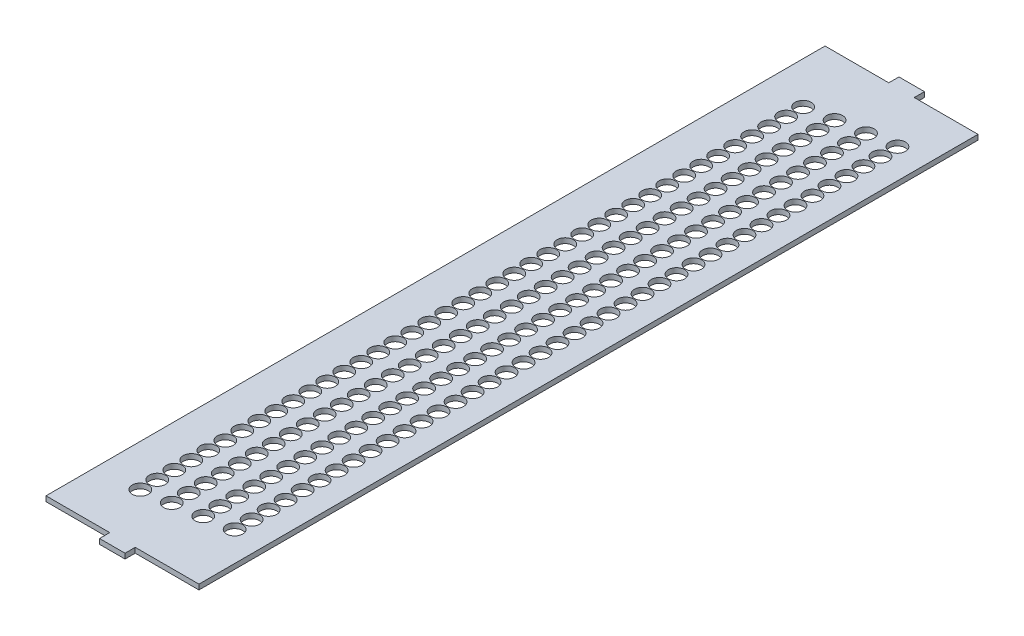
from build123d import *

# Parameters (mm, degrees)
CROQUIS1_R              = 4.75
SALIENTE_EXTRUIR1_DEPTH = 3


with BuildPart() as part:
    # Croquis1 → Saliente-Extruir1 (new body)
    with BuildSketch(Plane(origin=(0, 0, 0), x_dir=(1, 0, 0), z_dir=(0, 1, 0))):
        Polygon((0, 0), (37.5, 0), (37.5, -6), (52.5, -6), (52.5, 0), (90, 0), (90, 458.4), (52.5, 458.4), (52.5, 464.4), (37.5, 464.4), (37.5, 458.4), (0, 458.4), align=None)
        with Locations(Location((24.6, 420.9, 0), (0, 0, 270))):
            Circle(CROQUIS1_R, mode=Mode.SUBTRACT)
        with Locations(Location((40.6, 423.4, 0), (0, 0, 270))):
            Circle(CROQUIS1_R, mode=Mode.SUBTRACT)
        with Locations(Location((56.6, 425.9, 0), (0, 0, 270))):
            Circle(CROQUIS1_R, mode=Mode.SUBTRACT)
        with Locations(Location((72.6, 428.4, 0), (0, 0, 270))):
            Circle(CROQUIS1_R, mode=Mode.SUBTRACT)
        with Locations(Location((24.6, 410.9, 0), (0, 0, 270))):
            Circle(CROQUIS1_R, mode=Mode.SUBTRACT)
        with Locations(Location((40.6, 413.4, 0), (0, 0, 270))):
            Circle(CROQUIS1_R, mode=Mode.SUBTRACT)
        with Locations(Location((56.6, 415.9, 0), (0, 0, 270))):
            Circle(CROQUIS1_R, mode=Mode.SUBTRACT)
        with Locations(Location((72.6, 418.4, 0), (0, 0, 270))):
            Circle(CROQUIS1_R, mode=Mode.SUBTRACT)
        with Locations(Location((24.6, 400.9, 0), (0, 0, 270))):
            Circle(CROQUIS1_R, mode=Mode.SUBTRACT)
        with Locations(Location((40.6, 403.4, 0), (0, 0, 270))):
            Circle(CROQUIS1_R, mode=Mode.SUBTRACT)
        with Locations(Location((56.6, 405.9, 0), (0, 0, 270))):
            Circle(CROQUIS1_R, mode=Mode.SUBTRACT)
        with Locations(Location((72.6, 408.4, 0), (0, 0, 270))):
            Circle(CROQUIS1_R, mode=Mode.SUBTRACT)
        with Locations(Location((24.6, 390.9, 0), (0, 0, 270))):
            Circle(CROQUIS1_R, mode=Mode.SUBTRACT)
        with Locations(Location((40.6, 393.4, 0), (0, 0, 270))):
            Circle(CROQUIS1_R, mode=Mode.SUBTRACT)
        with Locations(Location((56.6, 395.9, 0), (0, 0, 270))):
            Circle(CROQUIS1_R, mode=Mode.SUBTRACT)
        with Locations(Location((72.6, 398.4, 0), (0, 0, 270))):
            Circle(CROQUIS1_R, mode=Mode.SUBTRACT)
        with Locations(Location((24.6, 380.9, 0), (0, 0, 270))):
            Circle(CROQUIS1_R, mode=Mode.SUBTRACT)
        with Locations(Location((40.6, 383.4, 0), (0, 0, 270))):
            Circle(CROQUIS1_R, mode=Mode.SUBTRACT)
        with Locations(Location((56.6, 385.9, 0), (0, 0, 270))):
            Circle(CROQUIS1_R, mode=Mode.SUBTRACT)
        with Locations(Location((72.6, 388.4, 0), (0, 0, 270))):
            Circle(CROQUIS1_R, mode=Mode.SUBTRACT)
        with Locations(Location((24.6, 370.9, 0), (0, 0, 270))):
            Circle(CROQUIS1_R, mode=Mode.SUBTRACT)
        with Locations(Location((40.6, 373.4, 0), (0, 0, 270))):
            Circle(CROQUIS1_R, mode=Mode.SUBTRACT)
        with Locations(Location((56.6, 375.9, 0), (0, 0, 270))):
            Circle(CROQUIS1_R, mode=Mode.SUBTRACT)
        with Locations(Location((72.6, 378.4, 0), (0, 0, 270))):
            Circle(CROQUIS1_R, mode=Mode.SUBTRACT)
        with Locations(Location((24.6, 360.9, 0), (0, 0, 270))):
            Circle(CROQUIS1_R, mode=Mode.SUBTRACT)
        with Locations(Location((40.6, 363.4, 0), (0, 0, 270))):
            Circle(CROQUIS1_R, mode=Mode.SUBTRACT)
        with Locations(Location((56.6, 365.9, 0), (0, 0, 270))):
            Circle(CROQUIS1_R, mode=Mode.SUBTRACT)
        with Locations(Location((72.6, 368.4, 0), (0, 0, 270))):
            Circle(CROQUIS1_R, mode=Mode.SUBTRACT)
        with Locations(Location((24.6, 350.9, 0), (0, 0, 270))):
            Circle(CROQUIS1_R, mode=Mode.SUBTRACT)
        with Locations(Location((40.6, 353.4, 0), (0, 0, 270))):
            Circle(CROQUIS1_R, mode=Mode.SUBTRACT)
        with Locations(Location((56.6, 355.9, 0), (0, 0, 270))):
            Circle(CROQUIS1_R, mode=Mode.SUBTRACT)
        with Locations(Location((72.6, 358.4, 0), (0, 0, 270))):
            Circle(CROQUIS1_R, mode=Mode.SUBTRACT)
        with Locations(Location((24.6, 340.9, 0), (0, 0, 270))):
            Circle(CROQUIS1_R, mode=Mode.SUBTRACT)
        with Locations(Location((40.6, 343.4, 0), (0, 0, 270))):
            Circle(CROQUIS1_R, mode=Mode.SUBTRACT)
        with Locations(Location((56.6, 345.9, 0), (0, 0, 270))):
            Circle(CROQUIS1_R, mode=Mode.SUBTRACT)
        with Locations(Location((72.6, 348.4, 0), (0, 0, 270))):
            Circle(CROQUIS1_R, mode=Mode.SUBTRACT)
        with Locations(Location((24.6, 330.9, 0), (0, 0, 270))):
            Circle(CROQUIS1_R, mode=Mode.SUBTRACT)
        with Locations(Location((40.6, 333.4, 0), (0, 0, 270))):
            Circle(CROQUIS1_R, mode=Mode.SUBTRACT)
        with Locations(Location((56.6, 335.9, 0), (0, 0, 270))):
            Circle(CROQUIS1_R, mode=Mode.SUBTRACT)
        with Locations(Location((72.6, 338.4, 0), (0, 0, 270))):
            Circle(CROQUIS1_R, mode=Mode.SUBTRACT)
        with Locations(Location((24.6, 320.9, 0), (0, 0, 270))):
            Circle(CROQUIS1_R, mode=Mode.SUBTRACT)
        with Locations(Location((40.6, 323.4, 0), (0, 0, 270))):
            Circle(CROQUIS1_R, mode=Mode.SUBTRACT)
        with Locations(Location((56.6, 325.9, 0), (0, 0, 270))):
            Circle(CROQUIS1_R, mode=Mode.SUBTRACT)
        with Locations(Location((72.6, 328.4, 0), (0, 0, 270))):
            Circle(CROQUIS1_R, mode=Mode.SUBTRACT)
        with Locations(Location((24.6, 310.9, 0), (0, 0, 270))):
            Circle(CROQUIS1_R, mode=Mode.SUBTRACT)
        with Locations(Location((40.6, 313.4, 0), (0, 0, 270))):
            Circle(CROQUIS1_R, mode=Mode.SUBTRACT)
        with Locations(Location((56.6, 315.9, 0), (0, 0, 270))):
            Circle(CROQUIS1_R, mode=Mode.SUBTRACT)
        with Locations(Location((72.6, 318.4, 0), (0, 0, 270))):
            Circle(CROQUIS1_R, mode=Mode.SUBTRACT)
        with Locations(Location((24.6, 300.9, 0), (0, 0, 270))):
            Circle(CROQUIS1_R, mode=Mode.SUBTRACT)
        with Locations(Location((40.6, 303.4, 0), (0, 0, 270))):
            Circle(CROQUIS1_R, mode=Mode.SUBTRACT)
        with Locations(Location((56.6, 305.9, 0), (0, 0, 270))):
            Circle(CROQUIS1_R, mode=Mode.SUBTRACT)
        with Locations(Location((72.6, 308.4, 0), (0, 0, 270))):
            Circle(CROQUIS1_R, mode=Mode.SUBTRACT)
        with Locations(Location((24.6, 290.9, 0), (0, 0, 270))):
            Circle(CROQUIS1_R, mode=Mode.SUBTRACT)
        with Locations(Location((40.6, 293.4, 0), (0, 0, 270))):
            Circle(CROQUIS1_R, mode=Mode.SUBTRACT)
        with Locations(Location((56.6, 295.9, 0), (0, 0, 270))):
            Circle(CROQUIS1_R, mode=Mode.SUBTRACT)
        with Locations(Location((72.6, 298.4, 0), (0, 0, 270))):
            Circle(CROQUIS1_R, mode=Mode.SUBTRACT)
        with Locations(Location((24.6, 280.9, 0), (0, 0, 270))):
            Circle(CROQUIS1_R, mode=Mode.SUBTRACT)
        with Locations(Location((40.6, 283.4, 0), (0, 0, 270))):
            Circle(CROQUIS1_R, mode=Mode.SUBTRACT)
        with Locations(Location((56.6, 285.9, 0), (0, 0, 270))):
            Circle(CROQUIS1_R, mode=Mode.SUBTRACT)
        with Locations(Location((72.6, 288.4, 0), (0, 0, 270))):
            Circle(CROQUIS1_R, mode=Mode.SUBTRACT)
        with Locations(Location((24.6, 270.9, 0), (0, 0, 270))):
            Circle(CROQUIS1_R, mode=Mode.SUBTRACT)
        with Locations(Location((40.6, 273.4, 0), (0, 0, 270))):
            Circle(CROQUIS1_R, mode=Mode.SUBTRACT)
        with Locations(Location((56.6, 275.9, 0), (0, 0, 270))):
            Circle(CROQUIS1_R, mode=Mode.SUBTRACT)
        with Locations(Location((72.6, 278.4, 0), (0, 0, 270))):
            Circle(CROQUIS1_R, mode=Mode.SUBTRACT)
        with Locations(Location((24.6, 260.9, 0), (0, 0, 270))):
            Circle(CROQUIS1_R, mode=Mode.SUBTRACT)
        with Locations(Location((40.6, 263.4, 0), (0, 0, 270))):
            Circle(CROQUIS1_R, mode=Mode.SUBTRACT)
        with Locations(Location((56.6, 265.9, 0), (0, 0, 270))):
            Circle(CROQUIS1_R, mode=Mode.SUBTRACT)
        with Locations(Location((72.6, 268.4, 0), (0, 0, 270))):
            Circle(CROQUIS1_R, mode=Mode.SUBTRACT)
        with Locations(Location((24.6, 250.9, 0), (0, 0, 270))):
            Circle(CROQUIS1_R, mode=Mode.SUBTRACT)
        with Locations(Location((40.6, 253.4, 0), (0, 0, 270))):
            Circle(CROQUIS1_R, mode=Mode.SUBTRACT)
        with Locations(Location((56.6, 255.9, 0), (0, 0, 270))):
            Circle(CROQUIS1_R, mode=Mode.SUBTRACT)
        with Locations(Location((72.6, 258.4, 0), (0, 0, 270))):
            Circle(CROQUIS1_R, mode=Mode.SUBTRACT)
        with Locations(Location((24.6, 240.9, 0), (0, 0, 270))):
            Circle(CROQUIS1_R, mode=Mode.SUBTRACT)
        with Locations(Location((40.6, 243.4, 0), (0, 0, 270))):
            Circle(CROQUIS1_R, mode=Mode.SUBTRACT)
        with Locations(Location((56.6, 245.9, 0), (0, 0, 270))):
            Circle(CROQUIS1_R, mode=Mode.SUBTRACT)
        with Locations(Location((72.6, 248.4, 0), (0, 0, 270))):
            Circle(CROQUIS1_R, mode=Mode.SUBTRACT)
        with Locations(Location((24.6, 230.9, 0), (0, 0, 270))):
            Circle(CROQUIS1_R, mode=Mode.SUBTRACT)
        with Locations(Location((40.6, 233.4, 0), (0, 0, 270))):
            Circle(CROQUIS1_R, mode=Mode.SUBTRACT)
        with Locations(Location((56.6, 235.9, 0), (0, 0, 270))):
            Circle(CROQUIS1_R, mode=Mode.SUBTRACT)
        with Locations(Location((72.6, 238.4, 0), (0, 0, 270))):
            Circle(CROQUIS1_R, mode=Mode.SUBTRACT)
        with Locations(Location((24.6, 220.9, 0), (0, 0, 270))):
            Circle(CROQUIS1_R, mode=Mode.SUBTRACT)
        with Locations(Location((40.6, 223.4, 0), (0, 0, 270))):
            Circle(CROQUIS1_R, mode=Mode.SUBTRACT)
        with Locations(Location((56.6, 225.9, 0), (0, 0, 270))):
            Circle(CROQUIS1_R, mode=Mode.SUBTRACT)
        with Locations(Location((72.6, 228.4, 0), (0, 0, 270))):
            Circle(CROQUIS1_R, mode=Mode.SUBTRACT)
        with Locations(Location((24.6, 210.9, 0), (0, 0, 270))):
            Circle(CROQUIS1_R, mode=Mode.SUBTRACT)
        with Locations(Location((40.6, 213.4, 0), (0, 0, 270))):
            Circle(CROQUIS1_R, mode=Mode.SUBTRACT)
        with Locations(Location((56.6, 215.9, 0), (0, 0, 270))):
            Circle(CROQUIS1_R, mode=Mode.SUBTRACT)
        with Locations(Location((72.6, 218.4, 0), (0, 0, 270))):
            Circle(CROQUIS1_R, mode=Mode.SUBTRACT)
        with Locations(Location((24.6, 200.9, 0), (0, 0, 270))):
            Circle(CROQUIS1_R, mode=Mode.SUBTRACT)
        with Locations(Location((40.6, 203.4, 0), (0, 0, 270))):
            Circle(CROQUIS1_R, mode=Mode.SUBTRACT)
        with Locations(Location((56.6, 205.9, 0), (0, 0, 270))):
            Circle(CROQUIS1_R, mode=Mode.SUBTRACT)
        with Locations(Location((72.6, 208.4, 0), (0, 0, 270))):
            Circle(CROQUIS1_R, mode=Mode.SUBTRACT)
        with Locations(Location((24.6, 190.9, 0), (0, 0, 270))):
            Circle(CROQUIS1_R, mode=Mode.SUBTRACT)
        with Locations(Location((40.6, 193.4, 0), (0, 0, 270))):
            Circle(CROQUIS1_R, mode=Mode.SUBTRACT)
        with Locations(Location((56.6, 195.9, 0), (0, 0, 270))):
            Circle(CROQUIS1_R, mode=Mode.SUBTRACT)
        with Locations(Location((72.6, 198.4, 0), (0, 0, 270))):
            Circle(CROQUIS1_R, mode=Mode.SUBTRACT)
        with Locations(Location((24.6, 180.9, 0), (0, 0, 270))):
            Circle(CROQUIS1_R, mode=Mode.SUBTRACT)
        with Locations(Location((40.6, 183.4, 0), (0, 0, 270))):
            Circle(CROQUIS1_R, mode=Mode.SUBTRACT)
        with Locations(Location((56.6, 185.9, 0), (0, 0, 270))):
            Circle(CROQUIS1_R, mode=Mode.SUBTRACT)
        with Locations(Location((72.6, 188.4, 0), (0, 0, 270))):
            Circle(CROQUIS1_R, mode=Mode.SUBTRACT)
        with Locations(Location((24.6, 170.9, 0), (0, 0, 270))):
            Circle(CROQUIS1_R, mode=Mode.SUBTRACT)
        with Locations(Location((40.6, 173.4, 0), (0, 0, 270))):
            Circle(CROQUIS1_R, mode=Mode.SUBTRACT)
        with Locations(Location((56.6, 175.9, 0), (0, 0, 270))):
            Circle(CROQUIS1_R, mode=Mode.SUBTRACT)
        with Locations(Location((72.6, 178.4, 0), (0, 0, 270))):
            Circle(CROQUIS1_R, mode=Mode.SUBTRACT)
        with Locations(Location((24.6, 160.9, 0), (0, 0, 270))):
            Circle(CROQUIS1_R, mode=Mode.SUBTRACT)
        with Locations(Location((40.6, 163.4, 0), (0, 0, 270))):
            Circle(CROQUIS1_R, mode=Mode.SUBTRACT)
        with Locations(Location((56.6, 165.9, 0), (0, 0, 270))):
            Circle(CROQUIS1_R, mode=Mode.SUBTRACT)
        with Locations(Location((72.6, 168.4, 0), (0, 0, 270))):
            Circle(CROQUIS1_R, mode=Mode.SUBTRACT)
        with Locations(Location((24.6, 150.9, 0), (0, 0, 270))):
            Circle(CROQUIS1_R, mode=Mode.SUBTRACT)
        with Locations(Location((40.6, 153.4, 0), (0, 0, 270))):
            Circle(CROQUIS1_R, mode=Mode.SUBTRACT)
        with Locations(Location((56.6, 155.9, 0), (0, 0, 270))):
            Circle(CROQUIS1_R, mode=Mode.SUBTRACT)
        with Locations(Location((72.6, 158.4, 0), (0, 0, 270))):
            Circle(CROQUIS1_R, mode=Mode.SUBTRACT)
        with Locations(Location((24.6, 140.9, 0), (0, 0, 270))):
            Circle(CROQUIS1_R, mode=Mode.SUBTRACT)
        with Locations(Location((40.6, 143.4, 0), (0, 0, 270))):
            Circle(CROQUIS1_R, mode=Mode.SUBTRACT)
        with Locations(Location((56.6, 145.9, 0), (0, 0, 270))):
            Circle(CROQUIS1_R, mode=Mode.SUBTRACT)
        with Locations(Location((72.6, 148.4, 0), (0, 0, 270))):
            Circle(CROQUIS1_R, mode=Mode.SUBTRACT)
        with Locations(Location((24.6, 130.9, 0), (0, 0, 270))):
            Circle(CROQUIS1_R, mode=Mode.SUBTRACT)
        with Locations(Location((40.6, 133.4, 0), (0, 0, 270))):
            Circle(CROQUIS1_R, mode=Mode.SUBTRACT)
        with Locations(Location((56.6, 135.9, 0), (0, 0, 270))):
            Circle(CROQUIS1_R, mode=Mode.SUBTRACT)
        with Locations(Location((72.6, 138.4, 0), (0, 0, 270))):
            Circle(CROQUIS1_R, mode=Mode.SUBTRACT)
        with Locations(Location((24.6, 120.9, 0), (0, 0, 270))):
            Circle(CROQUIS1_R, mode=Mode.SUBTRACT)
        with Locations(Location((40.6, 123.4, 0), (0, 0, 270))):
            Circle(CROQUIS1_R, mode=Mode.SUBTRACT)
        with Locations(Location((56.6, 125.9, 0), (0, 0, 270))):
            Circle(CROQUIS1_R, mode=Mode.SUBTRACT)
        with Locations(Location((72.6, 128.4, 0), (0, 0, 270))):
            Circle(CROQUIS1_R, mode=Mode.SUBTRACT)
        with Locations(Location((24.6, 110.9, 0), (0, 0, 270))):
            Circle(CROQUIS1_R, mode=Mode.SUBTRACT)
        with Locations(Location((40.6, 113.4, 0), (0, 0, 270))):
            Circle(CROQUIS1_R, mode=Mode.SUBTRACT)
        with Locations(Location((56.6, 115.9, 0), (0, 0, 270))):
            Circle(CROQUIS1_R, mode=Mode.SUBTRACT)
        with Locations(Location((72.6, 118.4, 0), (0, 0, 270))):
            Circle(CROQUIS1_R, mode=Mode.SUBTRACT)
        with Locations(Location((24.6, 100.9, 0), (0, 0, 270))):
            Circle(CROQUIS1_R, mode=Mode.SUBTRACT)
        with Locations(Location((40.6, 103.4, 0), (0, 0, 270))):
            Circle(CROQUIS1_R, mode=Mode.SUBTRACT)
        with Locations(Location((56.6, 105.9, 0), (0, 0, 270))):
            Circle(CROQUIS1_R, mode=Mode.SUBTRACT)
        with Locations(Location((72.6, 108.4, 0), (0, 0, 270))):
            Circle(CROQUIS1_R, mode=Mode.SUBTRACT)
        with Locations(Location((24.6, 90.9, 0), (0, 0, 270))):
            Circle(CROQUIS1_R, mode=Mode.SUBTRACT)
        with Locations(Location((40.6, 93.4, 0), (0, 0, 270))):
            Circle(CROQUIS1_R, mode=Mode.SUBTRACT)
        with Locations(Location((56.6, 95.9, 0), (0, 0, 270))):
            Circle(CROQUIS1_R, mode=Mode.SUBTRACT)
        with Locations(Location((72.6, 98.4, 0), (0, 0, 270))):
            Circle(CROQUIS1_R, mode=Mode.SUBTRACT)
        with Locations(Location((24.6, 80.9, 0), (0, 0, 270))):
            Circle(CROQUIS1_R, mode=Mode.SUBTRACT)
        with Locations(Location((40.6, 83.4, 0), (0, 0, 270))):
            Circle(CROQUIS1_R, mode=Mode.SUBTRACT)
        with Locations(Location((56.6, 85.9, 0), (0, 0, 270))):
            Circle(CROQUIS1_R, mode=Mode.SUBTRACT)
        with Locations(Location((72.6, 88.4, 0), (0, 0, 270))):
            Circle(CROQUIS1_R, mode=Mode.SUBTRACT)
        with Locations(Location((24.6, 70.9, 0), (0, 0, 270))):
            Circle(CROQUIS1_R, mode=Mode.SUBTRACT)
        with Locations(Location((40.6, 73.4, 0), (0, 0, 270))):
            Circle(CROQUIS1_R, mode=Mode.SUBTRACT)
        with Locations(Location((56.6, 75.9, 0), (0, 0, 270))):
            Circle(CROQUIS1_R, mode=Mode.SUBTRACT)
        with Locations(Location((72.6, 78.4, 0), (0, 0, 270))):
            Circle(CROQUIS1_R, mode=Mode.SUBTRACT)
        with Locations(Location((24.6, 60.9, 0), (0, 0, 270))):
            Circle(CROQUIS1_R, mode=Mode.SUBTRACT)
        with Locations(Location((40.6, 63.4, 0), (0, 0, 270))):
            Circle(CROQUIS1_R, mode=Mode.SUBTRACT)
        with Locations(Location((56.6, 65.9, 0), (0, 0, 270))):
            Circle(CROQUIS1_R, mode=Mode.SUBTRACT)
        with Locations(Location((72.6, 68.4, 0), (0, 0, 270))):
            Circle(CROQUIS1_R, mode=Mode.SUBTRACT)
        with Locations(Location((24.6, 50.9, 0), (0, 0, 270))):
            Circle(CROQUIS1_R, mode=Mode.SUBTRACT)
        with Locations(Location((40.6, 53.4, 0), (0, 0, 270))):
            Circle(CROQUIS1_R, mode=Mode.SUBTRACT)
        with Locations(Location((56.6, 55.9, 0), (0, 0, 270))):
            Circle(CROQUIS1_R, mode=Mode.SUBTRACT)
        with Locations(Location((72.6, 58.4, 0), (0, 0, 270))):
            Circle(CROQUIS1_R, mode=Mode.SUBTRACT)
        with Locations(Location((24.6, 40.9, 0), (0, 0, 270))):
            Circle(CROQUIS1_R, mode=Mode.SUBTRACT)
        with Locations(Location((40.6, 43.4, 0), (0, 0, 270))):
            Circle(CROQUIS1_R, mode=Mode.SUBTRACT)
        with Locations(Location((56.6, 45.9, 0), (0, 0, 270))):
            Circle(CROQUIS1_R, mode=Mode.SUBTRACT)
        with Locations(Location((72.6, 48.4, 0), (0, 0, 270))):
            Circle(CROQUIS1_R, mode=Mode.SUBTRACT)
        with Locations(Location((24.6, 30.9, 0), (0, 0, 270))):
            Circle(CROQUIS1_R, mode=Mode.SUBTRACT)
        with Locations(Location((40.6, 33.4, 0), (0, 0, 270))):
            Circle(CROQUIS1_R, mode=Mode.SUBTRACT)
        with Locations(Location((56.6, 35.9, 0), (0, 0, 270))):
            Circle(CROQUIS1_R, mode=Mode.SUBTRACT)
        with Locations(Location((72.6, 38.4, 0), (0, 0, 270))):
            Circle(CROQUIS1_R, mode=Mode.SUBTRACT)
    extrude(amount=SALIENTE_EXTRUIR1_DEPTH)


solid = part.part
